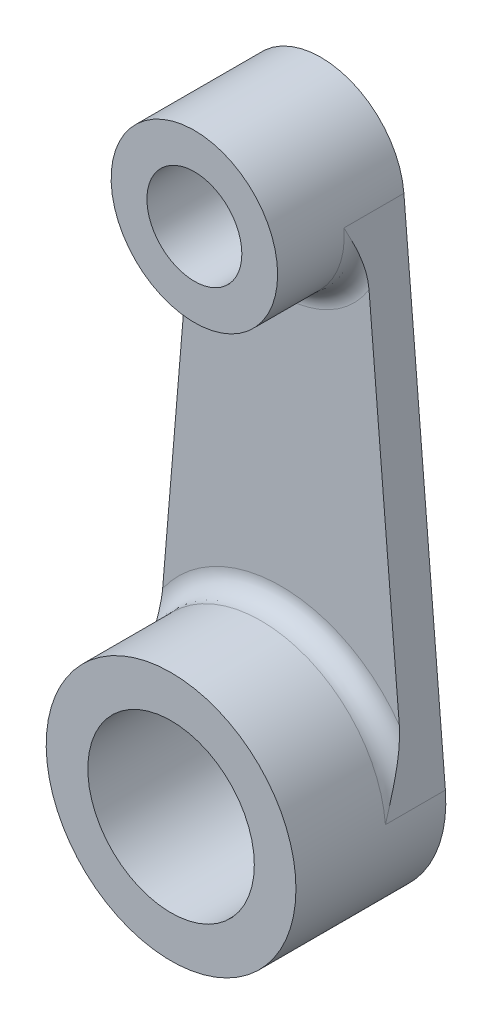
ISO-10303-21;
HEADER;
FILE_DESCRIPTION(('STEP AP214'),'2;1');
FILE_NAME('part.step','',(''),(''),'','','');
FILE_SCHEMA(('AUTOMOTIVE_DESIGN { 1 0 10303 214 1 1 1 1 }'));
ENDSEC;
DATA;
#1=APPLICATION_CONTEXT('core data for automotive mechanical design processes');
#2=APPLICATION_PROTOCOL_DEFINITION('international standard','automotive_design',2000,#1);
#3=PRODUCT_CONTEXT('',#1,'mechanical');
#4=PRODUCT('Part','Part','',(#3));
#5=PRODUCT_RELATED_PRODUCT_CATEGORY('part','',(#4));
#6=PRODUCT_DEFINITION_FORMATION('','',#4);
#7=PRODUCT_DEFINITION_CONTEXT('part definition',#1,'design');
#8=PRODUCT_DEFINITION('design','',#6,#7);
#9=PRODUCT_DEFINITION_SHAPE('','',#8);
#10=(LENGTH_UNIT() NAMED_UNIT(*) SI_UNIT(.MILLI.,.METRE.));
#11=(NAMED_UNIT(*) PLANE_ANGLE_UNIT() SI_UNIT($,.RADIAN.));
#12=(NAMED_UNIT(*) SI_UNIT($,.STERADIAN.) SOLID_ANGLE_UNIT());
#13=UNCERTAINTY_MEASURE_WITH_UNIT(LENGTH_MEASURE(1.E-05),#10,'distance_accuracy_value','');
#14=(GEOMETRIC_REPRESENTATION_CONTEXT(3) GLOBAL_UNCERTAINTY_ASSIGNED_CONTEXT((#13)) GLOBAL_UNIT_ASSIGNED_CONTEXT((#10,
#11,#12)) REPRESENTATION_CONTEXT('',''));
#15=CARTESIAN_POINT('',(0.,0.,0.));
#16=DIRECTION('',(0.,0.,1.));
#17=DIRECTION('',(1.,0.,0.));
#18=AXIS2_PLACEMENT_3D('',#15,#16,#17);
#19=CARTESIAN_POINT('',(0.,0.,45.));
#20=DIRECTION('',(0.,0.,-1.));
#21=DIRECTION('',(-1.,0.,0.));
#22=AXIS2_PLACEMENT_3D('',#19,#20,#21);
#23=CYLINDRICAL_SURFACE('',#22,37.5);
#24=CARTESIAN_POINT('',(0.,0.,18.));
#25=DIRECTION('',(0.,0.,1.));
#26=DIRECTION('',(1.,0.,0.));
#27=AXIS2_PLACEMENT_3D('',#24,#25,#26);
#28=CIRCLE('',#27,37.5);
#29=CARTESIAN_POINT('',(37.3695648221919,3.125,18.));
#30=VERTEX_POINT('',#29);
#31=CARTESIAN_POINT('',(-37.3695648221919,3.125,18.));
#32=VERTEX_POINT('',#31);
#33=EDGE_CURVE('E140',#30,#32,#28,.T.);
#34=ORIENTED_EDGE('',*,*,#33,.T.);
#35=DIRECTION('',(0.,0.,-1.));
#36=VECTOR('',#35,1.);
#37=CARTESIAN_POINT('',(-37.3695648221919,3.125,12.));
#38=LINE('',#37,#36);
#39=CARTESIAN_POINT('',(-37.3695648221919,3.125,0.));
#40=VERTEX_POINT('',#39);
#41=EDGE_CURVE('E104',#32,#40,#38,.T.);
#42=ORIENTED_EDGE('',*,*,#41,.T.);
#43=CARTESIAN_POINT('',(0.,0.,0.));
#44=DIRECTION('',(0.,0.,1.));
#45=DIRECTION('',(1.,0.,0.));
#46=AXIS2_PLACEMENT_3D('',#43,#44,#45);
#47=CIRCLE('',#46,37.5);
#48=CARTESIAN_POINT('',(37.3695648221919,3.125,0.));
#49=VERTEX_POINT('',#48);
#50=EDGE_CURVE('E103',#40,#49,#47,.T.);
#51=ORIENTED_EDGE('',*,*,#50,.T.);
#52=DIRECTION('',(0.,0.,-1.));
#53=VECTOR('',#52,1.);
#54=CARTESIAN_POINT('',(37.3695648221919,3.125,12.));
#55=LINE('',#54,#53);
#56=EDGE_CURVE('E133',#30,#49,#55,.T.);
#57=ORIENTED_EDGE('',*,*,#56,.F.);
#58=EDGE_LOOP('',(#34,#42,#51,#57));
#59=FACE_BOUND('',#58,.T.);
#60=CARTESIAN_POINT('',(0.,0.,45.));
#61=DIRECTION('',(0.,0.,1.));
#62=DIRECTION('',(1.,0.,0.));
#63=AXIS2_PLACEMENT_3D('',#60,#61,#62);
#64=CIRCLE('',#63,37.5);
#65=CARTESIAN_POINT('',(37.5,0.,45.));
#66=VERTEX_POINT('',#65);
#67=EDGE_CURVE('E137',#66,#66,#64,.T.);
#68=ORIENTED_EDGE('',*,*,#67,.F.);
#69=EDGE_LOOP('',(#68));
#70=FACE_BOUND('',#69,.T.);
#71=ADVANCED_FACE('F39',(#59,#70),#23,.T.);
#72=CARTESIAN_POINT('',(0.,0.,45.));
#73=DIRECTION('',(0.,0.,1.));
#74=DIRECTION('',(1.,0.,0.));
#75=AXIS2_PLACEMENT_3D('',#72,#73,#74);
#76=PLANE('',#75);
#77=CARTESIAN_POINT('',(0.,0.,45.));
#78=DIRECTION('',(0.,0.,1.));
#79=DIRECTION('',(1.,0.,0.));
#80=AXIS2_PLACEMENT_3D('',#77,#78,#79);
#81=CIRCLE('',#80,25.);
#82=CARTESIAN_POINT('',(25.,0.,45.));
#83=VERTEX_POINT('',#82);
#84=EDGE_CURVE('E121',#83,#83,#81,.T.);
#85=ORIENTED_EDGE('',*,*,#84,.F.);
#86=EDGE_LOOP('',(#85));
#87=FACE_BOUND('',#86,.T.);
#88=ORIENTED_EDGE('',*,*,#67,.T.);
#89=EDGE_LOOP('',(#88));
#90=FACE_BOUND('',#89,.T.);
#91=ADVANCED_FACE('F175',(#87,#90),#76,.T.);
#92=CARTESIAN_POINT('',(0.,0.,0.));
#93=DIRECTION('',(0.,0.,1.));
#94=DIRECTION('',(1.,0.,0.));
#95=AXIS2_PLACEMENT_3D('',#92,#93,#94);
#96=PLANE('',#95);
#97=CARTESIAN_POINT('',(0.,150.,0.));
#98=DIRECTION('',(0.,0.,1.));
#99=DIRECTION('',(1.,0.,0.));
#100=AXIS2_PLACEMENT_3D('',#97,#98,#99);
#101=CIRCLE('',#100,14.25);
#102=CARTESIAN_POINT('',(14.25,150.,0.));
#103=VERTEX_POINT('',#102);
#104=EDGE_CURVE('E145',#103,#103,#101,.T.);
#105=ORIENTED_EDGE('',*,*,#104,.T.);
#106=EDGE_LOOP('',(#105));
#107=FACE_BOUND('',#106,.T.);
#108=CARTESIAN_POINT('',(0.,0.,0.));
#109=DIRECTION('',(0.,0.,1.));
#110=DIRECTION('',(1.,0.,0.));
#111=AXIS2_PLACEMENT_3D('',#108,#109,#110);
#112=CIRCLE('',#111,25.);
#113=CARTESIAN_POINT('',(25.,0.,0.));
#114=VERTEX_POINT('',#113);
#115=EDGE_CURVE('E116',#114,#114,#112,.T.);
#116=ORIENTED_EDGE('',*,*,#115,.T.);
#117=EDGE_LOOP('',(#116));
#118=FACE_BOUND('',#117,.T.);
#119=ORIENTED_EDGE('',*,*,#50,.F.);
#120=DIRECTION('',(-0.0833333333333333,-0.996521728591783,0.));
#121=VECTOR('',#120,1.);
#122=CARTESIAN_POINT('',(-37.3695648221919,3.125,0.));
#123=LINE('',#122,#121);
#124=CARTESIAN_POINT('',(-24.9130432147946,152.083333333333,0.));
#125=VERTEX_POINT('',#124);
#126=EDGE_CURVE('E99',#125,#40,#123,.T.);
#127=ORIENTED_EDGE('',*,*,#126,.F.);
#128=CARTESIAN_POINT('',(0.,150.,0.));
#129=DIRECTION('',(0.,0.,1.));
#130=DIRECTION('',(1.,0.,0.));
#131=AXIS2_PLACEMENT_3D('',#128,#129,#130);
#132=CIRCLE('',#131,25.);
#133=CARTESIAN_POINT('',(24.9130432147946,152.083333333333,0.));
#134=VERTEX_POINT('',#133);
#135=EDGE_CURVE('E110',#134,#125,#132,.T.);
#136=ORIENTED_EDGE('',*,*,#135,.F.);
#137=DIRECTION('',(0.0833333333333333,-0.996521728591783,0.));
#138=VECTOR('',#137,1.);
#139=CARTESIAN_POINT('',(37.3695648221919,3.125,0.));
#140=LINE('',#139,#138);
#141=EDGE_CURVE('E112',#134,#49,#140,.T.);
#142=ORIENTED_EDGE('',*,*,#141,.T.);
#143=EDGE_LOOP('',(#119,#127,#136,#142));
#144=FACE_BOUND('',#143,.T.);
#145=ADVANCED_FACE('F108',(#107,#118,#144),#96,.F.);
#146=CARTESIAN_POINT('',(-37.3695648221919,3.125,12.));
#147=DIRECTION('',(0.996521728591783,-0.0833333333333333,0.));
#148=DIRECTION('',(0.0833333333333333,0.996521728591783,0.));
#149=AXIS2_PLACEMENT_3D('',#146,#147,#148);
#150=PLANE('',#149);
#151=ORIENTED_EDGE('',*,*,#126,.T.);
#152=ORIENTED_EDGE('',*,*,#41,.F.);
#153=CARTESIAN_POINT('',(-35.5324475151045,25.0937277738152,12.));
#154=CARTESIAN_POINT('',(-35.5505159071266,24.8776612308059,12.0000045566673));
#155=CARTESIAN_POINT('',(-35.5685828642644,24.6616118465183,12.0030180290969));
#156=CARTESIAN_POINT('',(-35.6047023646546,24.2296854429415,12.0147019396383));
#157=CARTESIAN_POINT('',(-35.6227549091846,24.0138084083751,12.0233718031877));
#158=CARTESIAN_POINT('',(-35.6768565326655,23.3668470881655,12.0573115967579));
#159=CARTESIAN_POINT('',(-35.7128722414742,22.9361618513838,12.090512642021));
#160=CARTESIAN_POINT('',(-35.7846483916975,22.0778439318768,12.1754388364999));
#161=CARTESIAN_POINT('',(-35.8204092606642,21.6502061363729,12.2271134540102));
#162=CARTESIAN_POINT('',(-35.8917442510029,20.7971637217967,12.3468576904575));
#163=CARTESIAN_POINT('',(-35.927318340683,20.3717594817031,12.4149300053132));
#164=CARTESIAN_POINT('',(-35.9979165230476,19.5275280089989,12.5648607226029));
#165=CARTESIAN_POINT('',(-36.0329426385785,19.1086765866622,12.646583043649));
#166=CARTESIAN_POINT('',(-36.102775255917,18.2735999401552,12.8226323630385));
#167=CARTESIAN_POINT('',(-36.1375817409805,17.8573749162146,12.9169603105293));
#168=CARTESIAN_POINT('',(-36.2417131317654,16.6121445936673,13.2167662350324));
#169=CARTESIAN_POINT('',(-36.310704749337,15.787124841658,13.438966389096));
#170=CARTESIAN_POINT('',(-36.4632722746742,13.9626825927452,13.9716129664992));
#171=CARTESIAN_POINT('',(-36.5466359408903,12.9657981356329,14.2906651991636));
#172=CARTESIAN_POINT('',(-36.7123451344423,10.9842043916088,14.96509606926));
#173=CARTESIAN_POINT('',(-36.7946903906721,9.99949834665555,15.3204841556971));
#174=CARTESIAN_POINT('',(-37.0409540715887,7.05461303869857,16.4226599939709));
#175=CARTESIAN_POINT('',(-37.2037745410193,5.10756341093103,17.2042065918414));
#176=CARTESIAN_POINT('',(-37.3675670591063,3.14888977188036,17.9904107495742));
#177=CARTESIAN_POINT('',(-37.3685659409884,3.13694488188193,17.9952053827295));
#178=CARTESIAN_POINT('',(-37.3695648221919,3.125,18.));
#179=B_SPLINE_CURVE_WITH_KNOTS('',3,(#153,#154,#155,#156,#157,#158,#159,#160,#161,#162,#163,
#164,#165,#166,#167,#168,#169,#170,#171,#172,#173,#174,#175,#176,#177,#178),.UNSPECIFIED.,.F.,
.F.,(4,2,2,2,2,2,2,2,2,2,2,2,4),(0.,0.650412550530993,1.30075904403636,2.60063792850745,
3.89698805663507,5.19355146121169,6.47788609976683,7.76231749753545,10.3328333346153,
13.4818723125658,16.6317322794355,22.9437538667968,22.9824837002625),.UNSPECIFIED.);
#180=CARTESIAN_POINT('',(-35.5324475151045,25.0937277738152,12.));
#181=VERTEX_POINT('',#180);
#182=EDGE_CURVE('E154',#32,#181,#179,.F.);
#183=ORIENTED_EDGE('',*,*,#182,.T.);
#184=DIRECTION('',(-0.0833333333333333,-0.996521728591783,0.));
#185=VECTOR('',#184,1.);
#186=CARTESIAN_POINT('',(-37.3695648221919,3.125,12.));
#187=LINE('',#186,#185);
#188=CARTESIAN_POINT('',(-26.4405684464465,133.816788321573,12.));
#189=VERTEX_POINT('',#188);
#190=EDGE_CURVE('E125',#189,#181,#187,.T.);
#191=ORIENTED_EDGE('',*,*,#190,.F.);
#192=CARTESIAN_POINT('',(-26.4405684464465,133.816788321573,12.));
#193=CARTESIAN_POINT('',(-26.4133283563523,134.142532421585,12.0000327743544));
#194=CARTESIAN_POINT('',(-26.3860965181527,134.46817784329,12.0093375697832));
#195=CARTESIAN_POINT('',(-26.3317234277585,135.118385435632,12.0447737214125));
#196=CARTESIAN_POINT('',(-26.304582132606,135.442948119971,12.0708954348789));
#197=CARTESIAN_POINT('',(-26.2505120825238,136.089531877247,12.1381533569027));
#198=CARTESIAN_POINT('',(-26.223582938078,136.411557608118,12.1792454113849));
#199=CARTESIAN_POINT('',(-26.1698903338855,137.053627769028,12.2749827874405));
#200=CARTESIAN_POINT('',(-26.1431269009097,137.373671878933,12.3296302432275));
#201=CARTESIAN_POINT('',(-26.0638088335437,138.322178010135,12.5102969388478));
#202=CARTESIAN_POINT('',(-26.0115308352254,138.947331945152,12.6539796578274));
#203=CARTESIAN_POINT('',(-25.9077882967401,140.187912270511,12.9798696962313));
#204=CARTESIAN_POINT('',(-25.8563244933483,140.803329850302,13.1621099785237));
#205=CARTESIAN_POINT('',(-25.7668627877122,141.873136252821,13.5085686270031));
#206=CARTESIAN_POINT('',(-25.7286825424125,142.329705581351,13.6660961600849));
#207=CARTESIAN_POINT('',(-25.6527642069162,143.237556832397,13.9958516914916));
#208=CARTESIAN_POINT('',(-25.6150261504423,143.68883835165,14.1680808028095));
#209=CARTESIAN_POINT('',(-25.5024184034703,145.035431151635,14.7029123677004));
#210=CARTESIAN_POINT('',(-25.4281495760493,145.923557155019,15.0836813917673));
#211=CARTESIAN_POINT('',(-25.2804998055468,147.689191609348,15.8771310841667));
#212=CARTESIAN_POINT('',(-25.2071231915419,148.566648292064,16.2899251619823));
#213=CARTESIAN_POINT('',(-25.060966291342,150.314430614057,17.1304855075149));
#214=CARTESIAN_POINT('',(-24.9881860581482,151.184755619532,17.5582530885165));
#215=CARTESIAN_POINT('',(-24.9146208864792,152.064467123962,17.9907252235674));
#216=CARTESIAN_POINT('',(-24.9138320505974,152.07390022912,17.9953626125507));
#217=CARTESIAN_POINT('',(-24.9130432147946,152.083333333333,18.));
#218=B_SPLINE_CURVE_WITH_KNOTS('',3,(#192,#193,#194,#195,#196,#197,#198,#199,#200,#201,#202,
#203,#204,#205,#206,#207,#208,#209,#210,#211,#212,#213,#214,#215,#216,#217),.UNSPECIFIED.,.F.,
.F.,(4,2,2,2,2,2,2,2,2,2,2,2,4),(0.,0.980368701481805,1.96017576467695,2.93711604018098,
3.9142102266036,5.84327000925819,7.77398565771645,9.22717291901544,10.6804702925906,
13.5868543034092,16.504046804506,19.4214958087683,19.4531185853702),.UNSPECIFIED.);
#219=CARTESIAN_POINT('',(-24.9130432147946,152.083333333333,18.));
#220=VERTEX_POINT('',#219);
#221=EDGE_CURVE('E11',#189,#220,#218,.T.);
#222=ORIENTED_EDGE('',*,*,#221,.T.);
#223=DIRECTION('',(0.,0.,-1.));
#224=VECTOR('',#223,1.);
#225=CARTESIAN_POINT('',(-24.9130432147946,152.083333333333,12.));
#226=LINE('',#225,#224);
#227=EDGE_CURVE('E68',#220,#125,#226,.T.);
#228=ORIENTED_EDGE('',*,*,#227,.T.);
#229=EDGE_LOOP('',(#151,#152,#183,#191,#222,#228));
#230=FACE_BOUND('',#229,.T.);
#231=ADVANCED_FACE('F98',(#230),#150,.F.);
#232=CARTESIAN_POINT('',(37.3695648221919,3.125,12.));
#233=DIRECTION('',(0.996521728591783,0.0833333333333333,0.));
#234=DIRECTION('',(-0.0833333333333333,0.996521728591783,0.));
#235=AXIS2_PLACEMENT_3D('',#232,#233,#234);
#236=PLANE('',#235);
#237=ORIENTED_EDGE('',*,*,#141,.F.);
#238=DIRECTION('',(0.,0.,-1.));
#239=VECTOR('',#238,1.);
#240=CARTESIAN_POINT('',(24.9130432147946,152.083333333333,12.));
#241=LINE('',#240,#239);
#242=CARTESIAN_POINT('',(24.9130432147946,152.083333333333,18.));
#243=VERTEX_POINT('',#242);
#244=EDGE_CURVE('E60',#243,#134,#241,.T.);
#245=ORIENTED_EDGE('',*,*,#244,.F.);
#246=CARTESIAN_POINT('',(26.4405684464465,133.816788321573,12.));
#247=CARTESIAN_POINT('',(26.4133283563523,134.142532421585,12.0000327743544));
#248=CARTESIAN_POINT('',(26.3860965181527,134.46817784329,12.0093375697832));
#249=CARTESIAN_POINT('',(26.3317234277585,135.118385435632,12.0447737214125));
#250=CARTESIAN_POINT('',(26.304582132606,135.442948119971,12.0708954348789));
#251=CARTESIAN_POINT('',(26.2505120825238,136.089531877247,12.1381533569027));
#252=CARTESIAN_POINT('',(26.223582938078,136.411557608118,12.1792454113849));
#253=CARTESIAN_POINT('',(26.1698903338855,137.053627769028,12.2749827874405));
#254=CARTESIAN_POINT('',(26.1431269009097,137.373671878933,12.3296302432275));
#255=CARTESIAN_POINT('',(26.0638088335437,138.322178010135,12.5102969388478));
#256=CARTESIAN_POINT('',(26.0115308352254,138.947331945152,12.6539796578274));
#257=CARTESIAN_POINT('',(25.9077882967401,140.187912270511,12.9798696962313));
#258=CARTESIAN_POINT('',(25.8563244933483,140.803329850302,13.1621099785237));
#259=CARTESIAN_POINT('',(25.7668627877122,141.873136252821,13.5085686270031));
#260=CARTESIAN_POINT('',(25.7286825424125,142.329705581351,13.6660961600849));
#261=CARTESIAN_POINT('',(25.6527642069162,143.237556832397,13.9958516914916));
#262=CARTESIAN_POINT('',(25.6150261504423,143.68883835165,14.1680808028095));
#263=CARTESIAN_POINT('',(25.5024184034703,145.035431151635,14.7029123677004));
#264=CARTESIAN_POINT('',(25.4281495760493,145.923557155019,15.0836813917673));
#265=CARTESIAN_POINT('',(25.2804998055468,147.689191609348,15.8771310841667));
#266=CARTESIAN_POINT('',(25.2071231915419,148.566648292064,16.2899251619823));
#267=CARTESIAN_POINT('',(25.060966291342,150.314430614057,17.1304855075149));
#268=CARTESIAN_POINT('',(24.9881860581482,151.184755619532,17.5582530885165));
#269=CARTESIAN_POINT('',(24.9146208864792,152.064467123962,17.9907252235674));
#270=CARTESIAN_POINT('',(24.9138320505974,152.07390022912,17.9953626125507));
#271=CARTESIAN_POINT('',(24.9130432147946,152.083333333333,18.));
#272=B_SPLINE_CURVE_WITH_KNOTS('',3,(#246,#247,#248,#249,#250,#251,#252,#253,#254,#255,#256,
#257,#258,#259,#260,#261,#262,#263,#264,#265,#266,#267,#268,#269,#270,#271),.UNSPECIFIED.,.F.,
.F.,(4,2,2,2,2,2,2,2,2,2,2,2,4),(0.,0.980368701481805,1.96017576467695,2.93711604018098,
3.9142102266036,5.84327000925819,7.77398565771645,9.22717291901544,10.6804702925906,
13.5868543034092,16.504046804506,19.4214958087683,19.4531185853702),.UNSPECIFIED.);
#273=CARTESIAN_POINT('',(26.4405684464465,133.816788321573,12.));
#274=VERTEX_POINT('',#273);
#275=EDGE_CURVE('E53',#243,#274,#272,.F.);
#276=ORIENTED_EDGE('',*,*,#275,.T.);
#277=DIRECTION('',(0.0833333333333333,-0.996521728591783,0.));
#278=VECTOR('',#277,1.);
#279=CARTESIAN_POINT('',(37.3695648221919,3.125,12.));
#280=LINE('',#279,#278);
#281=CARTESIAN_POINT('',(35.5324475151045,25.0937277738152,12.));
#282=VERTEX_POINT('',#281);
#283=EDGE_CURVE('E128',#274,#282,#280,.T.);
#284=ORIENTED_EDGE('',*,*,#283,.T.);
#285=CARTESIAN_POINT('',(35.5324475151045,25.0937277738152,12.));
#286=CARTESIAN_POINT('',(35.5505159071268,24.8776612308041,12.0000045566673));
#287=CARTESIAN_POINT('',(35.5685828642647,24.6616118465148,12.003018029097));
#288=CARTESIAN_POINT('',(35.6047023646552,24.2296854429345,12.0147019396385));
#289=CARTESIAN_POINT('',(35.6227549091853,24.0138084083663,12.023371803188));
#290=CARTESIAN_POINT('',(35.6768565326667,23.3668470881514,12.0573115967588));
#291=CARTESIAN_POINT('',(35.7128722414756,22.9361618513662,12.0905126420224));
#292=CARTESIAN_POINT('',(35.7846483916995,22.0778439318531,12.1754388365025));
#293=CARTESIAN_POINT('',(35.8204092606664,21.6502061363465,12.2271134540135));
#294=CARTESIAN_POINT('',(35.8917442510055,20.7971637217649,12.3468576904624));
#295=CARTESIAN_POINT('',(35.9273183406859,20.3717594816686,12.4149300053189));
#296=CARTESIAN_POINT('',(35.9979165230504,19.5275280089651,12.5648607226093));
#297=CARTESIAN_POINT('',(36.032942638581,19.1086765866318,12.6465830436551));
#298=CARTESIAN_POINT('',(36.102775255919,18.2735999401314,12.8226323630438));
#299=CARTESIAN_POINT('',(36.1375817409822,17.8573749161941,12.9169603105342));
#300=CARTESIAN_POINT('',(36.2417131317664,16.6121445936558,13.2167662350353));
#301=CARTESIAN_POINT('',(36.3107047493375,15.7871248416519,13.4389663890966));
#302=CARTESIAN_POINT('',(36.4632722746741,13.9626825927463,13.9716129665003));
#303=CARTESIAN_POINT('',(36.54663594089,12.9657981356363,14.2906651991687));
#304=CARTESIAN_POINT('',(36.7123451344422,10.9842043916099,14.9650960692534));
#305=CARTESIAN_POINT('',(36.7946903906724,9.99949834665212,15.3204841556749));
#306=CARTESIAN_POINT('',(37.040954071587,7.05461303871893,16.4226599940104));
#307=CARTESIAN_POINT('',(37.2037745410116,5.1075634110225,17.2042065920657));
#308=CARTESIAN_POINT('',(37.3675670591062,3.1488897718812,17.9904107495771));
#309=CARTESIAN_POINT('',(37.3685659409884,3.13694488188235,17.995205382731));
#310=CARTESIAN_POINT('',(37.3695648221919,3.125,18.));
#311=B_SPLINE_CURVE_WITH_KNOTS('',3,(#285,#286,#287,#288,#289,#290,#291,#292,#293,#294,#295,
#296,#297,#298,#299,#300,#301,#302,#303,#304,#305,#306,#307,#308,#309,#310),.UNSPECIFIED.,.F.,
.F.,(4,2,2,2,2,2,2,2,2,2,2,2,4),(0.,0.650412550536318,1.30075904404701,2.6006379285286,
3.8969880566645,5.19355146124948,6.47788609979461,7.76231749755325,10.3328333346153,
13.4818723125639,16.6317322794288,22.9437538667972,22.9824837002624),.UNSPECIFIED.);
#312=EDGE_CURVE('E160',#282,#30,#311,.T.);
#313=ORIENTED_EDGE('',*,*,#312,.T.);
#314=ORIENTED_EDGE('',*,*,#56,.T.);
#315=EDGE_LOOP('',(#237,#245,#276,#284,#313,#314));
#316=FACE_BOUND('',#315,.T.);
#317=ADVANCED_FACE('F172',(#316),#236,.T.);
#318=CARTESIAN_POINT('',(0.,0.,12.));
#319=DIRECTION('',(0.,0.,1.));
#320=DIRECTION('',(1.,0.,0.));
#321=AXIS2_PLACEMENT_3D('',#318,#319,#320);
#322=PLANE('',#321);
#323=ORIENTED_EDGE('',*,*,#190,.T.);
#324=CARTESIAN_POINT('',(0.,0.,12.));
#325=DIRECTION('',(0.,0.,1.));
#326=DIRECTION('',(1.,0.,0.));
#327=AXIS2_PLACEMENT_3D('',#324,#325,#326);
#328=CIRCLE('',#327,43.5);
#329=EDGE_CURVE('E150',#181,#282,#328,.F.);
#330=ORIENTED_EDGE('',*,*,#329,.T.);
#331=ORIENTED_EDGE('',*,*,#283,.F.);
#332=CARTESIAN_POINT('',(0.,150.,12.));
#333=DIRECTION('',(0.,0.,1.));
#334=DIRECTION('',(1.,0.,0.));
#335=AXIS2_PLACEMENT_3D('',#332,#333,#334);
#336=CIRCLE('',#335,31.);
#337=EDGE_CURVE('E148',#274,#189,#336,.F.);
#338=ORIENTED_EDGE('',*,*,#337,.T.);
#339=EDGE_LOOP('',(#323,#330,#331,#338));
#340=FACE_BOUND('',#339,.T.);
#341=ADVANCED_FACE('F197',(#340),#322,.T.);
#342=CARTESIAN_POINT('',(0.,150.,38.));
#343=DIRECTION('',(0.,0.,-1.));
#344=DIRECTION('',(-1.,0.,0.));
#345=AXIS2_PLACEMENT_3D('',#342,#343,#344);
#346=CYLINDRICAL_SURFACE('',#345,25.);
#347=CARTESIAN_POINT('',(0.,150.,38.));
#348=DIRECTION('',(0.,0.,1.));
#349=DIRECTION('',(1.,0.,0.));
#350=AXIS2_PLACEMENT_3D('',#347,#348,#349);
#351=CIRCLE('',#350,25.);
#352=CARTESIAN_POINT('',(25.,150.,38.));
#353=VERTEX_POINT('',#352);
#354=EDGE_CURVE('E113',#353,#353,#351,.T.);
#355=ORIENTED_EDGE('',*,*,#354,.F.);
#356=EDGE_LOOP('',(#355));
#357=FACE_BOUND('',#356,.T.);
#358=CARTESIAN_POINT('',(0.,150.,18.));
#359=DIRECTION('',(0.,0.,1.));
#360=DIRECTION('',(1.,0.,0.));
#361=AXIS2_PLACEMENT_3D('',#358,#359,#360);
#362=CIRCLE('',#361,25.);
#363=EDGE_CURVE('E152',#220,#243,#362,.T.);
#364=ORIENTED_EDGE('',*,*,#363,.T.);
#365=ORIENTED_EDGE('',*,*,#244,.T.);
#366=ORIENTED_EDGE('',*,*,#135,.T.);
#367=ORIENTED_EDGE('',*,*,#227,.F.);
#368=EDGE_LOOP('',(#364,#365,#366,#367));
#369=FACE_BOUND('',#368,.T.);
#370=ADVANCED_FACE('F115',(#357,#369),#346,.T.);
#371=CARTESIAN_POINT('',(0.,0.,38.));
#372=DIRECTION('',(0.,0.,1.));
#373=DIRECTION('',(1.,0.,0.));
#374=AXIS2_PLACEMENT_3D('',#371,#372,#373);
#375=PLANE('',#374);
#376=CARTESIAN_POINT('',(0.,150.,38.));
#377=DIRECTION('',(0.,0.,1.));
#378=DIRECTION('',(1.,0.,0.));
#379=AXIS2_PLACEMENT_3D('',#376,#377,#378);
#380=CIRCLE('',#379,14.25);
#381=CARTESIAN_POINT('',(14.25,150.,38.));
#382=VERTEX_POINT('',#381);
#383=EDGE_CURVE('E142',#382,#382,#380,.T.);
#384=ORIENTED_EDGE('',*,*,#383,.F.);
#385=EDGE_LOOP('',(#384));
#386=FACE_BOUND('',#385,.T.);
#387=ORIENTED_EDGE('',*,*,#354,.T.);
#388=EDGE_LOOP('',(#387));
#389=FACE_BOUND('',#388,.T.);
#390=ADVANCED_FACE('F212',(#386,#389),#375,.T.);
#391=CARTESIAN_POINT('',(0.,0.,0.));
#392=DIRECTION('',(0.,0.,1.));
#393=DIRECTION('',(1.,0.,0.));
#394=AXIS2_PLACEMENT_3D('',#391,#392,#393);
#395=CYLINDRICAL_SURFACE('',#394,25.);
#396=CARTESIAN_POINT('',(25.,0.,0.));
#397=CARTESIAN_POINT('',(25.,0.,0.468749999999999));
#398=CARTESIAN_POINT('',(25.,0.,0.9375));
#399=CARTESIAN_POINT('',(25.,0.,1.875));
#400=CARTESIAN_POINT('',(25.,0.,2.34375));
#401=CARTESIAN_POINT('',(25.,0.,3.28125));
#402=CARTESIAN_POINT('',(25.,0.,3.75));
#403=CARTESIAN_POINT('',(25.,0.,4.6875));
#404=CARTESIAN_POINT('',(25.,0.,5.15625));
#405=CARTESIAN_POINT('',(25.,0.,6.09375));
#406=CARTESIAN_POINT('',(25.,0.,6.5625));
#407=CARTESIAN_POINT('',(25.,0.,7.5));
#408=CARTESIAN_POINT('',(25.,0.,7.96875));
#409=CARTESIAN_POINT('',(25.,0.,8.90625));
#410=CARTESIAN_POINT('',(25.,0.,9.375));
#411=CARTESIAN_POINT('',(25.,0.,10.3125));
#412=CARTESIAN_POINT('',(25.,0.,10.78125));
#413=CARTESIAN_POINT('',(25.,0.,11.71875));
#414=CARTESIAN_POINT('',(25.,0.,12.1875));
#415=CARTESIAN_POINT('',(25.,0.,13.125));
#416=CARTESIAN_POINT('',(25.,0.,13.59375));
#417=CARTESIAN_POINT('',(25.,0.,14.53125));
#418=CARTESIAN_POINT('',(25.,0.,15.));
#419=CARTESIAN_POINT('',(25.,0.,15.9375));
#420=CARTESIAN_POINT('',(25.,0.,16.40625));
#421=CARTESIAN_POINT('',(25.,0.,17.34375));
#422=CARTESIAN_POINT('',(25.,0.,17.8125));
#423=CARTESIAN_POINT('',(25.,0.,18.75));
#424=CARTESIAN_POINT('',(25.,0.,19.21875));
#425=CARTESIAN_POINT('',(25.,0.,20.15625));
#426=CARTESIAN_POINT('',(25.,0.,20.625));
#427=CARTESIAN_POINT('',(25.,0.,21.5625));
#428=CARTESIAN_POINT('',(25.,0.,22.03125));
#429=CARTESIAN_POINT('',(25.,0.,22.96875));
#430=CARTESIAN_POINT('',(25.,0.,23.4375));
#431=CARTESIAN_POINT('',(25.,0.,24.375));
#432=CARTESIAN_POINT('',(25.,0.,24.84375));
#433=CARTESIAN_POINT('',(25.,0.,25.78125));
#434=CARTESIAN_POINT('',(25.,0.,26.25));
#435=CARTESIAN_POINT('',(25.,0.,27.1875));
#436=CARTESIAN_POINT('',(25.,0.,27.65625));
#437=CARTESIAN_POINT('',(25.,0.,28.59375));
#438=CARTESIAN_POINT('',(25.,0.,29.0625));
#439=CARTESIAN_POINT('',(25.,0.,30.));
#440=CARTESIAN_POINT('',(25.,0.,30.46875));
#441=CARTESIAN_POINT('',(25.,0.,31.40625));
#442=CARTESIAN_POINT('',(25.,0.,31.875));
#443=CARTESIAN_POINT('',(25.,0.,32.8125));
#444=CARTESIAN_POINT('',(25.,0.,33.28125));
#445=CARTESIAN_POINT('',(25.,0.,34.21875));
#446=CARTESIAN_POINT('',(25.,0.,34.6875));
#447=CARTESIAN_POINT('',(25.,0.,35.625));
#448=CARTESIAN_POINT('',(25.,0.,36.09375));
#449=CARTESIAN_POINT('',(25.,0.,37.03125));
#450=CARTESIAN_POINT('',(25.,0.,37.5));
#451=CARTESIAN_POINT('',(25.,0.,38.4375));
#452=CARTESIAN_POINT('',(25.,0.,38.90625));
#453=CARTESIAN_POINT('',(25.,0.,39.84375));
#454=CARTESIAN_POINT('',(25.,0.,40.3125));
#455=CARTESIAN_POINT('',(25.,0.,41.25));
#456=CARTESIAN_POINT('',(25.,0.,41.71875));
#457=CARTESIAN_POINT('',(25.,0.,42.65625));
#458=CARTESIAN_POINT('',(25.,0.,43.125));
#459=CARTESIAN_POINT('',(25.,0.,44.0625));
#460=CARTESIAN_POINT('',(25.,0.,44.53125));
#461=CARTESIAN_POINT('',(25.,0.,45.));
#462=B_SPLINE_CURVE_WITH_KNOTS('',3,(#396,#397,#398,#399,#400,#401,#402,#403,#404,#405,#406,
#407,#408,#409,#410,#411,#412,#413,#414,#415,#416,#417,#418,#419,#420,#421,#422,#423,#424,#425,
#426,#427,#428,#429,#430,#431,#432,#433,#434,#435,#436,#437,#438,#439,#440,#441,#442,#443,#444,
#445,#446,#447,#448,#449,#450,#451,#452,#453,#454,#455,#456,#457,#458,#459,#460,#461),
.UNSPECIFIED.,.F.,.F.,(4,2,2,2,2,2,2,2,2,2,2,2,2,2,2,2,2,2,2,2,2,2,2,2,2,2,2,2,2,2,2,2,4),(0.,
1.40625,2.8125,4.21875,5.625,7.03125,8.4375,9.84375,11.25,12.65625,14.0625,15.46875,16.875,
18.28125,19.6875,21.09375,22.5,23.90625,25.3125,26.71875,28.125,29.53125,30.9375,32.34375,33.75,
35.15625,36.5625,37.96875,39.375,40.78125,42.1875,43.59375,45.),.UNSPECIFIED.);
#463=EDGE_CURVE('BSEAM218',#114,#83,#462,.T.);
#464=ORIENTED_EDGE('',*,*,#115,.F.);
#465=ORIENTED_EDGE('',*,*,#84,.T.);
#466=ORIENTED_EDGE('',*,*,#463,.T.);
#467=ORIENTED_EDGE('',*,*,#463,.F.);
#468=EDGE_LOOP('',(#464,#466,#465,#467));
#469=FACE_BOUND('',#468,.T.);
#470=ADVANCED_FACE('F218',(#469),#395,.F.);
#471=CARTESIAN_POINT('',(0.,150.,0.));
#472=DIRECTION('',(0.,0.,1.));
#473=DIRECTION('',(1.,0.,0.));
#474=AXIS2_PLACEMENT_3D('',#471,#472,#473);
#475=CYLINDRICAL_SURFACE('',#474,14.25);
#476=CARTESIAN_POINT('',(14.25,150.,38.));
#477=CARTESIAN_POINT('',(14.25,150.,37.6041666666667));
#478=CARTESIAN_POINT('',(14.25,150.,37.2083333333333));
#479=CARTESIAN_POINT('',(14.25,150.,36.4166666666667));
#480=CARTESIAN_POINT('',(14.25,150.,36.0208333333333));
#481=CARTESIAN_POINT('',(14.25,150.,35.2291666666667));
#482=CARTESIAN_POINT('',(14.25,150.,34.8333333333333));
#483=CARTESIAN_POINT('',(14.25,150.,34.0416666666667));
#484=CARTESIAN_POINT('',(14.25,150.,33.6458333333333));
#485=CARTESIAN_POINT('',(14.25,150.,32.8541666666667));
#486=CARTESIAN_POINT('',(14.25,150.,32.4583333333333));
#487=CARTESIAN_POINT('',(14.25,150.,31.6666666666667));
#488=CARTESIAN_POINT('',(14.25,150.,31.2708333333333));
#489=CARTESIAN_POINT('',(14.25,150.,30.4791666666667));
#490=CARTESIAN_POINT('',(14.25,150.,30.0833333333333));
#491=CARTESIAN_POINT('',(14.25,150.,29.2916666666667));
#492=CARTESIAN_POINT('',(14.25,150.,28.8958333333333));
#493=CARTESIAN_POINT('',(14.25,150.,28.1041666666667));
#494=CARTESIAN_POINT('',(14.25,150.,27.7083333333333));
#495=CARTESIAN_POINT('',(14.25,150.,26.9166666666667));
#496=CARTESIAN_POINT('',(14.25,150.,26.5208333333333));
#497=CARTESIAN_POINT('',(14.25,150.,25.7291666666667));
#498=CARTESIAN_POINT('',(14.25,150.,25.3333333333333));
#499=CARTESIAN_POINT('',(14.25,150.,24.5416666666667));
#500=CARTESIAN_POINT('',(14.25,150.,24.1458333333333));
#501=CARTESIAN_POINT('',(14.25,150.,23.3541666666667));
#502=CARTESIAN_POINT('',(14.25,150.,22.9583333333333));
#503=CARTESIAN_POINT('',(14.25,150.,22.1666666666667));
#504=CARTESIAN_POINT('',(14.25,150.,21.7708333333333));
#505=CARTESIAN_POINT('',(14.25,150.,20.9791666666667));
#506=CARTESIAN_POINT('',(14.25,150.,20.5833333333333));
#507=CARTESIAN_POINT('',(14.25,150.,19.7916666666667));
#508=CARTESIAN_POINT('',(14.25,150.,19.3958333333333));
#509=CARTESIAN_POINT('',(14.25,150.,18.6041666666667));
#510=CARTESIAN_POINT('',(14.25,150.,18.2083333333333));
#511=CARTESIAN_POINT('',(14.25,150.,17.4166666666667));
#512=CARTESIAN_POINT('',(14.25,150.,17.0208333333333));
#513=CARTESIAN_POINT('',(14.25,150.,16.2291666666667));
#514=CARTESIAN_POINT('',(14.25,150.,15.8333333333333));
#515=CARTESIAN_POINT('',(14.25,150.,15.0416666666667));
#516=CARTESIAN_POINT('',(14.25,150.,14.6458333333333));
#517=CARTESIAN_POINT('',(14.25,150.,13.8541666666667));
#518=CARTESIAN_POINT('',(14.25,150.,13.4583333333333));
#519=CARTESIAN_POINT('',(14.25,150.,12.6666666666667));
#520=CARTESIAN_POINT('',(14.25,150.,12.2708333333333));
#521=CARTESIAN_POINT('',(14.25,150.,11.4791666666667));
#522=CARTESIAN_POINT('',(14.25,150.,11.0833333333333));
#523=CARTESIAN_POINT('',(14.25,150.,10.2916666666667));
#524=CARTESIAN_POINT('',(14.25,150.,9.89583333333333));
#525=CARTESIAN_POINT('',(14.25,150.,9.10416666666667));
#526=CARTESIAN_POINT('',(14.25,150.,8.70833333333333));
#527=CARTESIAN_POINT('',(14.25,150.,7.91666666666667));
#528=CARTESIAN_POINT('',(14.25,150.,7.52083333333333));
#529=CARTESIAN_POINT('',(14.25,150.,6.72916666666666));
#530=CARTESIAN_POINT('',(14.25,150.,6.33333333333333));
#531=CARTESIAN_POINT('',(14.25,150.,5.54166666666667));
#532=CARTESIAN_POINT('',(14.25,150.,5.14583333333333));
#533=CARTESIAN_POINT('',(14.25,150.,4.35416666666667));
#534=CARTESIAN_POINT('',(14.25,150.,3.95833333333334));
#535=CARTESIAN_POINT('',(14.25,150.,3.16666666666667));
#536=CARTESIAN_POINT('',(14.25,150.,2.77083333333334));
#537=CARTESIAN_POINT('',(14.25,150.,1.97916666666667));
#538=CARTESIAN_POINT('',(14.25,150.,1.58333333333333));
#539=CARTESIAN_POINT('',(14.25,150.,0.791666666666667));
#540=CARTESIAN_POINT('',(14.25,150.,0.395833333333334));
#541=CARTESIAN_POINT('',(14.25,150.,0.));
#542=B_SPLINE_CURVE_WITH_KNOTS('',3,(#476,#477,#478,#479,#480,#481,#482,#483,#484,#485,#486,
#487,#488,#489,#490,#491,#492,#493,#494,#495,#496,#497,#498,#499,#500,#501,#502,#503,#504,#505,
#506,#507,#508,#509,#510,#511,#512,#513,#514,#515,#516,#517,#518,#519,#520,#521,#522,#523,#524,
#525,#526,#527,#528,#529,#530,#531,#532,#533,#534,#535,#536,#537,#538,#539,#540,#541),
.UNSPECIFIED.,.F.,.F.,(4,2,2,2,2,2,2,2,2,2,2,2,2,2,2,2,2,2,2,2,2,2,2,2,2,2,2,2,2,2,2,2,4),(0.,
1.1875,2.375,3.5625,4.75,5.9375,7.125,8.3125,9.5,10.6875,11.875,13.0625,14.25,15.4375,16.625,
17.8125,19.,20.1875,21.375,22.5625,23.75,24.9375,26.125,27.3125,28.5,29.6875,30.875,32.0625,
33.25,34.4375,35.625,36.8125,38.),.UNSPECIFIED.);
#543=EDGE_CURVE('BSEAM222',#382,#103,#542,.T.);
#544=ORIENTED_EDGE('',*,*,#383,.T.);
#545=ORIENTED_EDGE('',*,*,#104,.F.);
#546=ORIENTED_EDGE('',*,*,#543,.T.);
#547=ORIENTED_EDGE('',*,*,#543,.F.);
#548=EDGE_LOOP('',(#544,#546,#545,#547));
#549=FACE_BOUND('',#548,.T.);
#550=ADVANCED_FACE('F222',(#549),#475,.F.);
#551=CARTESIAN_POINT('',(0.,0.,18.));
#552=DIRECTION('',(0.,0.,1.));
#553=DIRECTION('',(1.,0.,0.));
#554=AXIS2_PLACEMENT_3D('',#551,#552,#553);
#555=TOROIDAL_SURFACE('',#554,43.5,6.);
#556=ORIENTED_EDGE('',*,*,#312,.F.);
#557=ORIENTED_EDGE('',*,*,#329,.F.);
#558=ORIENTED_EDGE('',*,*,#182,.F.);
#559=ORIENTED_EDGE('',*,*,#33,.F.);
#560=EDGE_LOOP('',(#556,#557,#558,#559));
#561=FACE_BOUND('',#560,.T.);
#562=ADVANCED_FACE('F166',(#561),#555,.F.);
#563=CARTESIAN_POINT('',(0.,150.,18.));
#564=DIRECTION('',(0.,0.,1.));
#565=DIRECTION('',(1.,0.,0.));
#566=AXIS2_PLACEMENT_3D('',#563,#564,#565);
#567=TOROIDAL_SURFACE('',#566,31.,6.);
#568=ORIENTED_EDGE('',*,*,#221,.F.);
#569=ORIENTED_EDGE('',*,*,#337,.F.);
#570=ORIENTED_EDGE('',*,*,#275,.F.);
#571=ORIENTED_EDGE('',*,*,#363,.F.);
#572=EDGE_LOOP('',(#568,#569,#570,#571));
#573=FACE_BOUND('',#572,.T.);
#574=ADVANCED_FACE('F41',(#573),#567,.F.);
#575=CLOSED_SHELL('',(#71,#91,#145,#231,#317,#341,#370,#390,#470,#550,#562,#574));
#576=MANIFOLD_SOLID_BREP('B2',#575);
#577=ADVANCED_BREP_SHAPE_REPRESENTATION('',(#18,#576),#14);
#578=SHAPE_DEFINITION_REPRESENTATION(#9,#577);
ENDSEC;
END-ISO-10303-21;
